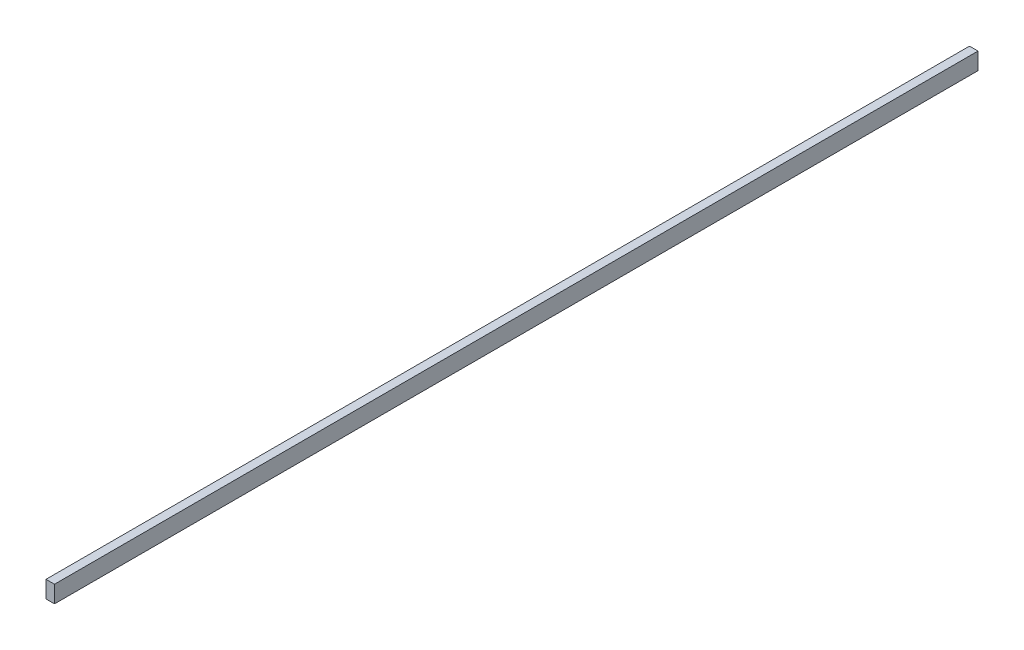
ISO-10303-21;
HEADER;
FILE_DESCRIPTION(('STEP AP214'),'2;1');
FILE_NAME('part.step','',(''),(''),'','','');
FILE_SCHEMA(('AUTOMOTIVE_DESIGN { 1 0 10303 214 1 1 1 1 }'));
ENDSEC;
DATA;
#1=APPLICATION_CONTEXT('core data for automotive mechanical design processes');
#2=APPLICATION_PROTOCOL_DEFINITION('international standard','automotive_design',2000,#1);
#3=PRODUCT_CONTEXT('',#1,'mechanical');
#4=PRODUCT('Part','Part','',(#3));
#5=PRODUCT_RELATED_PRODUCT_CATEGORY('part','',(#4));
#6=PRODUCT_DEFINITION_FORMATION('','',#4);
#7=PRODUCT_DEFINITION_CONTEXT('part definition',#1,'design');
#8=PRODUCT_DEFINITION('design','',#6,#7);
#9=PRODUCT_DEFINITION_SHAPE('','',#8);
#10=(LENGTH_UNIT() NAMED_UNIT(*) SI_UNIT(.MILLI.,.METRE.));
#11=(NAMED_UNIT(*) PLANE_ANGLE_UNIT() SI_UNIT($,.RADIAN.));
#12=(NAMED_UNIT(*) SI_UNIT($,.STERADIAN.) SOLID_ANGLE_UNIT());
#13=UNCERTAINTY_MEASURE_WITH_UNIT(LENGTH_MEASURE(1.E-05),#10,'distance_accuracy_value','');
#14=(GEOMETRIC_REPRESENTATION_CONTEXT(3) GLOBAL_UNCERTAINTY_ASSIGNED_CONTEXT((#13)) GLOBAL_UNIT_ASSIGNED_CONTEXT((#10,
#11,#12)) REPRESENTATION_CONTEXT('',''));
#15=CARTESIAN_POINT('',(0.,0.,0.));
#16=DIRECTION('',(0.,0.,1.));
#17=DIRECTION('',(1.,0.,0.));
#18=AXIS2_PLACEMENT_3D('',#15,#16,#17);
#19=CARTESIAN_POINT('',(0.,0.,542.31));
#20=DIRECTION('',(1.,0.,0.));
#21=DIRECTION('',(0.,0.,-1.));
#22=AXIS2_PLACEMENT_3D('',#19,#20,#21);
#23=PLANE('',#22);
#24=DIRECTION('',(0.,-1.,0.));
#25=VECTOR('',#24,1.);
#26=CARTESIAN_POINT('',(0.,0.,0.));
#27=LINE('',#26,#25);
#28=CARTESIAN_POINT('',(0.,10.,0.));
#29=VERTEX_POINT('',#28);
#30=CARTESIAN_POINT('',(0.,0.,0.));
#31=VERTEX_POINT('',#30);
#32=EDGE_CURVE('E70',#29,#31,#27,.T.);
#33=ORIENTED_EDGE('',*,*,#32,.T.);
#34=DIRECTION('',(0.,0.,-1.));
#35=VECTOR('',#34,1.);
#36=CARTESIAN_POINT('',(0.,0.,542.31));
#37=LINE('',#36,#35);
#38=CARTESIAN_POINT('',(0.,0.,542.31));
#39=VERTEX_POINT('',#38);
#40=EDGE_CURVE('E11',#39,#31,#37,.T.);
#41=ORIENTED_EDGE('',*,*,#40,.F.);
#42=DIRECTION('',(0.,-1.,0.));
#43=VECTOR('',#42,1.);
#44=CARTESIAN_POINT('',(0.,0.,542.31));
#45=LINE('',#44,#43);
#46=CARTESIAN_POINT('',(0.,10.,542.31));
#47=VERTEX_POINT('',#46);
#48=EDGE_CURVE('E88',#47,#39,#45,.T.);
#49=ORIENTED_EDGE('',*,*,#48,.F.);
#50=DIRECTION('',(0.,0.,-1.));
#51=VECTOR('',#50,1.);
#52=CARTESIAN_POINT('',(0.,10.,542.31));
#53=LINE('',#52,#51);
#54=EDGE_CURVE('E82',#47,#29,#53,.T.);
#55=ORIENTED_EDGE('',*,*,#54,.T.);
#56=EDGE_LOOP('',(#33,#41,#49,#55));
#57=FACE_BOUND('',#56,.T.);
#58=ADVANCED_FACE('F26',(#57),#23,.F.);
#59=CARTESIAN_POINT('',(0.,0.,542.31));
#60=DIRECTION('',(0.,1.,0.));
#61=DIRECTION('',(0.,0.,1.));
#62=AXIS2_PLACEMENT_3D('',#59,#60,#61);
#63=PLANE('',#62);
#64=DIRECTION('',(1.,0.,0.));
#65=VECTOR('',#64,1.);
#66=CARTESIAN_POINT('',(0.,0.,0.));
#67=LINE('',#66,#65);
#68=CARTESIAN_POINT('',(5.,0.,0.));
#69=VERTEX_POINT('',#68);
#70=EDGE_CURVE('E66',#31,#69,#67,.T.);
#71=ORIENTED_EDGE('',*,*,#70,.T.);
#72=DIRECTION('',(0.,0.,-1.));
#73=VECTOR('',#72,1.);
#74=CARTESIAN_POINT('',(5.,0.,542.31));
#75=LINE('',#74,#73);
#76=CARTESIAN_POINT('',(5.,0.,542.31));
#77=VERTEX_POINT('',#76);
#78=EDGE_CURVE('E33',#77,#69,#75,.T.);
#79=ORIENTED_EDGE('',*,*,#78,.F.);
#80=DIRECTION('',(1.,0.,0.));
#81=VECTOR('',#80,1.);
#82=CARTESIAN_POINT('',(0.,0.,542.31));
#83=LINE('',#82,#81);
#84=EDGE_CURVE('E78',#39,#77,#83,.T.);
#85=ORIENTED_EDGE('',*,*,#84,.F.);
#86=ORIENTED_EDGE('',*,*,#40,.T.);
#87=EDGE_LOOP('',(#71,#79,#85,#86));
#88=FACE_BOUND('',#87,.T.);
#89=ADVANCED_FACE('F77',(#88),#63,.F.);
#90=CARTESIAN_POINT('',(5.,0.,542.31));
#91=DIRECTION('',(-1.,0.,0.));
#92=DIRECTION('',(0.,0.,1.));
#93=AXIS2_PLACEMENT_3D('',#90,#91,#92);
#94=PLANE('',#93);
#95=DIRECTION('',(0.,1.,0.));
#96=VECTOR('',#95,1.);
#97=CARTESIAN_POINT('',(5.,0.,0.));
#98=LINE('',#97,#96);
#99=CARTESIAN_POINT('',(5.,10.,0.));
#100=VERTEX_POINT('',#99);
#101=EDGE_CURVE('E71',#69,#100,#98,.T.);
#102=ORIENTED_EDGE('',*,*,#101,.T.);
#103=DIRECTION('',(0.,0.,-1.));
#104=VECTOR('',#103,1.);
#105=CARTESIAN_POINT('',(5.,10.,542.31));
#106=LINE('',#105,#104);
#107=CARTESIAN_POINT('',(5.,10.,542.31));
#108=VERTEX_POINT('',#107);
#109=EDGE_CURVE('E94',#108,#100,#106,.T.);
#110=ORIENTED_EDGE('',*,*,#109,.F.);
#111=DIRECTION('',(0.,1.,0.));
#112=VECTOR('',#111,1.);
#113=CARTESIAN_POINT('',(5.,0.,542.31));
#114=LINE('',#113,#112);
#115=EDGE_CURVE('E45',#77,#108,#114,.T.);
#116=ORIENTED_EDGE('',*,*,#115,.F.);
#117=ORIENTED_EDGE('',*,*,#78,.T.);
#118=EDGE_LOOP('',(#102,#110,#116,#117));
#119=FACE_BOUND('',#118,.T.);
#120=ADVANCED_FACE('F97',(#119),#94,.F.);
#121=CARTESIAN_POINT('',(0.,10.,542.31));
#122=DIRECTION('',(0.,-1.,0.));
#123=DIRECTION('',(0.,0.,-1.));
#124=AXIS2_PLACEMENT_3D('',#121,#122,#123);
#125=PLANE('',#124);
#126=DIRECTION('',(-1.,0.,0.));
#127=VECTOR('',#126,1.);
#128=CARTESIAN_POINT('',(0.,10.,0.));
#129=LINE('',#128,#127);
#130=EDGE_CURVE('E86',#100,#29,#129,.T.);
#131=ORIENTED_EDGE('',*,*,#130,.T.);
#132=ORIENTED_EDGE('',*,*,#54,.F.);
#133=DIRECTION('',(-1.,0.,0.));
#134=VECTOR('',#133,1.);
#135=CARTESIAN_POINT('',(0.,10.,542.31));
#136=LINE('',#135,#134);
#137=EDGE_CURVE('E40',#108,#47,#136,.T.);
#138=ORIENTED_EDGE('',*,*,#137,.F.);
#139=ORIENTED_EDGE('',*,*,#109,.T.);
#140=EDGE_LOOP('',(#131,#132,#138,#139));
#141=FACE_BOUND('',#140,.T.);
#142=ADVANCED_FACE('F99',(#141),#125,.F.);
#143=CARTESIAN_POINT('',(0.,10.,542.31));
#144=DIRECTION('',(0.,0.,-1.));
#145=DIRECTION('',(-1.,0.,0.));
#146=AXIS2_PLACEMENT_3D('',#143,#144,#145);
#147=PLANE('',#146);
#148=ORIENTED_EDGE('',*,*,#48,.T.);
#149=ORIENTED_EDGE('',*,*,#84,.T.);
#150=ORIENTED_EDGE('',*,*,#115,.T.);
#151=ORIENTED_EDGE('',*,*,#137,.T.);
#152=EDGE_LOOP('',(#148,#149,#150,#151));
#153=FACE_BOUND('',#152,.T.);
#154=ADVANCED_FACE('F100',(#153),#147,.F.);
#155=CARTESIAN_POINT('',(0.,10.,0.));
#156=DIRECTION('',(0.,0.,-1.));
#157=DIRECTION('',(-1.,0.,0.));
#158=AXIS2_PLACEMENT_3D('',#155,#156,#157);
#159=PLANE('',#158);
#160=ORIENTED_EDGE('',*,*,#32,.F.);
#161=ORIENTED_EDGE('',*,*,#130,.F.);
#162=ORIENTED_EDGE('',*,*,#101,.F.);
#163=ORIENTED_EDGE('',*,*,#70,.F.);
#164=EDGE_LOOP('',(#160,#161,#162,#163));
#165=FACE_BOUND('',#164,.T.);
#166=ADVANCED_FACE('F67',(#165),#159,.T.);
#167=CLOSED_SHELL('',(#58,#89,#120,#142,#154,#166));
#168=MANIFOLD_SOLID_BREP('B2',#167);
#169=ADVANCED_BREP_SHAPE_REPRESENTATION('',(#18,#168),#14);
#170=SHAPE_DEFINITION_REPRESENTATION(#9,#169);
ENDSEC;
END-ISO-10303-21;
